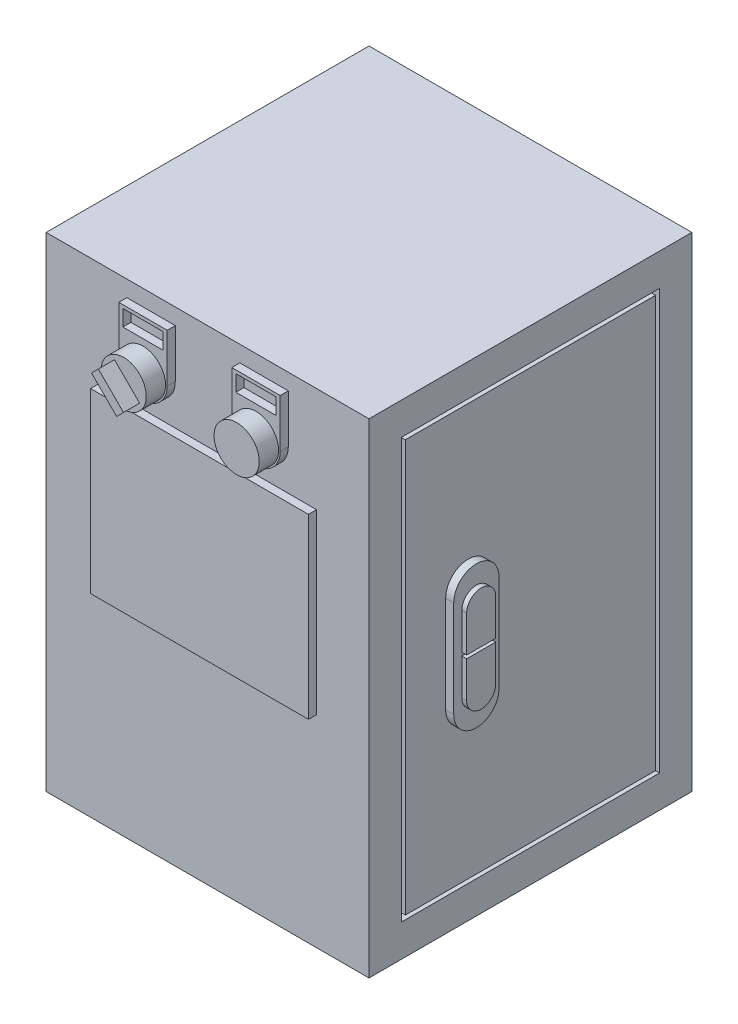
from build123d import *

# Parameters (mm, degrees)
SKETCH_1_W          = 200
SKETCH_1_H          = 200
EXTRUDE_1_DEPTH     = 300
SKETCH_2_W          = 25
SKETCH_2_H          = 10
EXTRUDE_2_DEPTH     = 5
EXTRUDE_2_2_DEPTH   = 5
SKETCH_3_R          = 14
EXTRUDE_3_DEPTH     = 12
EXTRUDE_3_2_DEPTH   = 12
EXTRUDE_4_DEPTH     = 10
SKETCH_5_W          = 135
SKETCH_5_H          = 110
EXTRUDE_5_DEPTH     = 5
SKETCH_6_W          = 160
SKETCH_6_H          = 260
SKETCH_6_W_2        = 155
SKETCH_6_H_2        = 255
CUT_EXTRUDE_1_DEPTH = 10
EXTRUDE_6_DEPTH     = 5
EXTRUDE_7_DEPTH     = 8
SKETCH_9_W          = 18
SKETCH_9_H          = 2
CUT_EXTRUDE_2_DEPTH = 3


with BuildPart() as part:
    # Sketch 1 → Extrude 1 (new body)
    with BuildSketch(Plane(origin=(0, 0, 0), x_dir=(1, 0, 0), z_dir=(0, 1, 0))):
        Rectangle(SKETCH_1_W, SKETCH_1_H)
    extrude(amount=EXTRUDE_1_DEPTH)

    # Sketch 6 → Cut-Extrude 1 (cut)
    with BuildSketch(Plane(origin=(100, 0, 0), x_dir=(0, 0, -1), z_dir=(1, 0, 0))):
        with Locations((0, 150)):
            Rectangle(SKETCH_6_W, SKETCH_6_H)
        with Locations((0, 150)):
            Rectangle(SKETCH_6_W_2, SKETCH_6_H_2, mode=Mode.SUBTRACT)
    extrude(amount=-CUT_EXTRUDE_1_DEPTH, mode=Mode.SUBTRACT)


with BuildPart() as body_2:
    # Sketch 2 → Extrude 2 (new body)
    with BuildSketch(Plane.XY.offset(100)):
        with BuildLine():
            Line((20, 290), (50, 290))
            Line((50, 290), (50, 260))
            ThreePointArc((50, 260), (35, 245), (20, 260))
            Line((20, 260), (20, 290))
        make_face()
        with Locations((35, 283)):
            Rectangle(SKETCH_2_W, SKETCH_2_H, mode=Mode.SUBTRACT)
    extrude(amount=EXTRUDE_2_DEPTH)


with BuildPart() as body_3:
    # Sketch 2 → Extrude 2 2 (new body)
    with BuildSketch(Plane.XY.offset(100)):
        with BuildLine():
            Line((-20, 290), (-50, 290))
            Line((-50, 290), (-50, 260))
            ThreePointArc((-50, 260), (-35, 245), (-20, 260))
            Line((-20, 260), (-20, 290))
        make_face()
        with Locations((-35, 283)):
            Rectangle(SKETCH_2_W, SKETCH_2_H, mode=Mode.SUBTRACT)
    extrude(amount=EXTRUDE_2_2_DEPTH)


with BuildPart() as body_4:
    # Sketch 3 → Extrude 3 (new body)
    with BuildSketch(Plane.XY.offset(105)):
        with Locations((-35, 260)):
            Circle(SKETCH_3_R)
    extrude(amount=EXTRUDE_3_DEPTH)


with BuildPart() as body_5:
    # Sketch 3 → Extrude 3 2 (new body)
    with BuildSketch(Plane.XY.offset(105)):
        with Locations((35, 260)):
            Circle(SKETCH_3_R)
    extrude(amount=EXTRUDE_3_2_DEPTH)


with BuildPart() as body_6:
    # Sketch 4 → Extrude 4 (new body)
    with BuildSketch(Plane.XY.offset(117)):
        Polygon((-42.778174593, 267.778174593), (-40.656854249, 269.899494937), (-25.100505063, 254.343145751), (-27.221825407, 252.221825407), (-29.343145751, 250.100505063), (-44.899494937, 265.656854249), align=None)
    extrude(amount=EXTRUDE_4_DEPTH)


with BuildPart() as body_7:
    # Sketch 5 → Extrude 5 (new body)
    with BuildSketch(Plane.XY.offset(100)):
        with Locations((0, 180)):
            Rectangle(SKETCH_5_W, SKETCH_5_H)
    extrude(amount=EXTRUDE_5_DEPTH)


with BuildPart() as body_8:
    # Sketch 7 → Extrude 6 (new body)
    with BuildSketch(Plane(origin=(100, 0, 0), x_dir=(0, 0, -1), z_dir=(1, 0, 0))):
        with BuildLine():
            Line((-52.5, 180), (-52.5, 120))
            ThreePointArc((-52.5, 120), (-38.5, 106), (-24.5, 120))
            Line((-24.5, 120), (-24.5, 180))
            ThreePointArc((-24.5, 180), (-38.5, 194), (-52.5, 180))
        make_face()
        with BuildLine():
            Line((-29.5, 173.5), (-29.5, 126.5))
            ThreePointArc((-29.5, 126.5), (-38.5, 117.5), (-47.5, 126.5))
            Line((-47.5, 126.5), (-47.5, 173.5))
            ThreePointArc((-47.5, 173.5), (-38.5, 182.5), (-29.5, 173.5))
        make_face(mode=Mode.SUBTRACT)
    extrude(amount=EXTRUDE_6_DEPTH)


with BuildPart() as body_9:
    # Sketch 8 → Extrude 7 (new body)
    with BuildSketch(Plane(origin=(100, 0, 0), x_dir=(0, 0, -1), z_dir=(1, 0, 0))):
        with BuildLine():
            Line((-29.5, 126.5), (-29.5, 173.5))
            ThreePointArc((-29.5, 173.5), (-38.5, 182.5), (-47.5, 173.5))
            Line((-47.5, 173.5), (-47.5, 126.5))
            ThreePointArc((-47.5, 126.5), (-38.5, 117.5), (-29.5, 126.5))
        make_face()
    extrude(amount=EXTRUDE_7_DEPTH)

    # Sketch 9 → Cut-Extrude 2 (cut)
    with BuildSketch(Plane(origin=(108, 0, 0), x_dir=(0, 0, -1), z_dir=(1, 0, 0))):
        with Locations((-38.5, 150)):
            Rectangle(SKETCH_9_W, SKETCH_9_H)
    extrude(amount=-CUT_EXTRUDE_2_DEPTH, mode=Mode.SUBTRACT)


solid = Compound([part.part, body_2.part, body_3.part, body_4.part, body_5.part, body_6.part, body_7.part, body_8.part, body_9.part])
